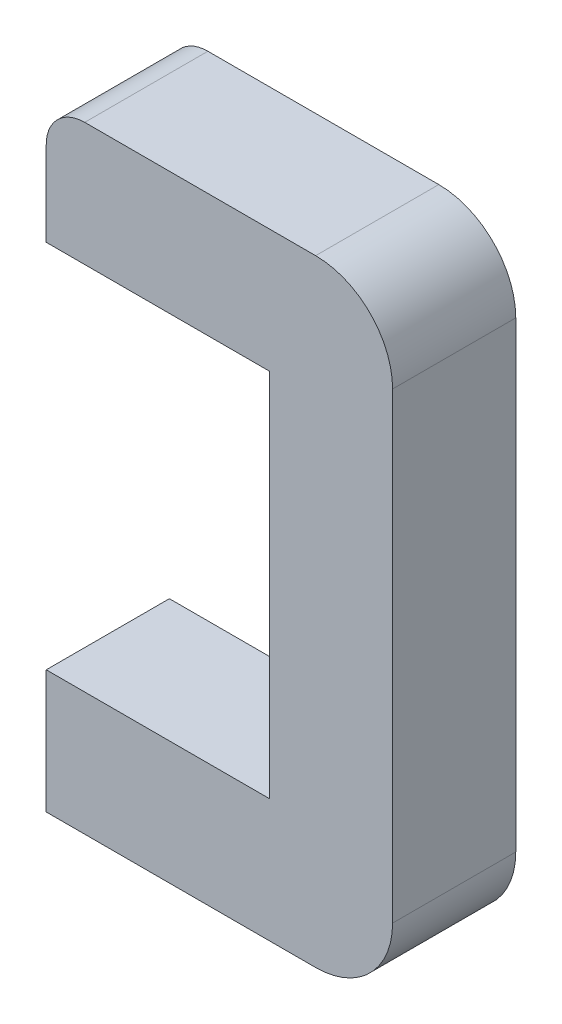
ISO-10303-21;
HEADER;
FILE_DESCRIPTION(('STEP AP214'),'2;1');
FILE_NAME('part.step','',(''),(''),'','','');
FILE_SCHEMA(('AUTOMOTIVE_DESIGN { 1 0 10303 214 1 1 1 1 }'));
ENDSEC;
DATA;
#1=APPLICATION_CONTEXT('core data for automotive mechanical design processes');
#2=APPLICATION_PROTOCOL_DEFINITION('international standard','automotive_design',2000,#1);
#3=PRODUCT_CONTEXT('',#1,'mechanical');
#4=PRODUCT('Part','Part','',(#3));
#5=PRODUCT_RELATED_PRODUCT_CATEGORY('part','',(#4));
#6=PRODUCT_DEFINITION_FORMATION('','',#4);
#7=PRODUCT_DEFINITION_CONTEXT('part definition',#1,'design');
#8=PRODUCT_DEFINITION('design','',#6,#7);
#9=PRODUCT_DEFINITION_SHAPE('','',#8);
#10=(LENGTH_UNIT() NAMED_UNIT(*) SI_UNIT(.MILLI.,.METRE.));
#11=(NAMED_UNIT(*) PLANE_ANGLE_UNIT() SI_UNIT($,.RADIAN.));
#12=(NAMED_UNIT(*) SI_UNIT($,.STERADIAN.) SOLID_ANGLE_UNIT());
#13=UNCERTAINTY_MEASURE_WITH_UNIT(LENGTH_MEASURE(1.E-05),#10,'distance_accuracy_value','');
#14=(GEOMETRIC_REPRESENTATION_CONTEXT(3) GLOBAL_UNCERTAINTY_ASSIGNED_CONTEXT((#13)) GLOBAL_UNIT_ASSIGNED_CONTEXT((#10,
#11,#12)) REPRESENTATION_CONTEXT('',''));
#15=CARTESIAN_POINT('',(0.,0.,0.));
#16=DIRECTION('',(0.,0.,1.));
#17=DIRECTION('',(1.,0.,0.));
#18=AXIS2_PLACEMENT_3D('',#15,#16,#17);
#19=CARTESIAN_POINT('',(30.4849743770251,15.1972857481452,16.));
#20=DIRECTION('',(1.,0.,0.));
#21=DIRECTION('',(0.,1.,0.));
#22=AXIS2_PLACEMENT_3D('',#19,#20,#21);
#23=PLANE('',#22);
#24=DIRECTION('',(0.,-1.,0.));
#25=VECTOR('',#24,1.);
#26=CARTESIAN_POINT('',(30.4849743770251,15.1972857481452,0.));
#27=LINE('',#26,#25);
#28=CARTESIAN_POINT('',(30.4849743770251,15.1972857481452,0.));
#29=VERTEX_POINT('',#28);
#30=CARTESIAN_POINT('',(30.4849743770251,-32.8967142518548,0.));
#31=VERTEX_POINT('',#30);
#32=EDGE_CURVE('E143',#29,#31,#27,.T.);
#33=ORIENTED_EDGE('',*,*,#32,.T.);
#34=DIRECTION('',(0.,0.,-1.));
#35=VECTOR('',#34,1.);
#36=CARTESIAN_POINT('',(30.4849743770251,-32.8967142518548,16.));
#37=LINE('',#36,#35);
#38=CARTESIAN_POINT('',(30.4849743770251,-32.8967142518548,16.));
#39=VERTEX_POINT('',#38);
#40=EDGE_CURVE('E125',#39,#31,#37,.T.);
#41=ORIENTED_EDGE('',*,*,#40,.F.);
#42=DIRECTION('',(0.,-1.,0.));
#43=VECTOR('',#42,1.);
#44=CARTESIAN_POINT('',(30.4849743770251,15.1972857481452,16.));
#45=LINE('',#44,#43);
#46=CARTESIAN_POINT('',(30.4849743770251,15.1972857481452,16.));
#47=VERTEX_POINT('',#46);
#48=EDGE_CURVE('E131',#47,#39,#45,.T.);
#49=ORIENTED_EDGE('',*,*,#48,.F.);
#50=DIRECTION('',(0.,0.,-1.));
#51=VECTOR('',#50,1.);
#52=CARTESIAN_POINT('',(30.4849743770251,15.1972857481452,16.));
#53=LINE('',#52,#51);
#54=EDGE_CURVE('E207',#47,#29,#53,.T.);
#55=ORIENTED_EDGE('',*,*,#54,.T.);
#56=EDGE_LOOP('',(#33,#41,#49,#55));
#57=FACE_BOUND('',#56,.T.);
#58=ADVANCED_FACE('F32',(#57),#23,.F.);
#59=CARTESIAN_POINT('',(1.48497437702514,-32.8967142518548,16.));
#60=DIRECTION('',(0.,-1.,0.));
#61=DIRECTION('',(1.,0.,0.));
#62=AXIS2_PLACEMENT_3D('',#59,#60,#61);
#63=PLANE('',#62);
#64=DIRECTION('',(-1.,0.,0.));
#65=VECTOR('',#64,1.);
#66=CARTESIAN_POINT('',(1.48497437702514,-32.8967142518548,0.));
#67=LINE('',#66,#65);
#68=CARTESIAN_POINT('',(1.48497437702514,-32.8967142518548,0.));
#69=VERTEX_POINT('',#68);
#70=EDGE_CURVE('E198',#31,#69,#67,.T.);
#71=ORIENTED_EDGE('',*,*,#70,.T.);
#72=DIRECTION('',(0.,0.,-1.));
#73=VECTOR('',#72,1.);
#74=CARTESIAN_POINT('',(1.48497437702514,-32.8967142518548,16.));
#75=LINE('',#74,#73);
#76=CARTESIAN_POINT('',(1.48497437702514,-32.8967142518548,16.));
#77=VERTEX_POINT('',#76);
#78=EDGE_CURVE('E128',#77,#69,#75,.T.);
#79=ORIENTED_EDGE('',*,*,#78,.F.);
#80=DIRECTION('',(-1.,0.,0.));
#81=VECTOR('',#80,1.);
#82=CARTESIAN_POINT('',(1.48497437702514,-32.8967142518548,16.));
#83=LINE('',#82,#81);
#84=EDGE_CURVE('E121',#39,#77,#83,.T.);
#85=ORIENTED_EDGE('',*,*,#84,.F.);
#86=ORIENTED_EDGE('',*,*,#40,.T.);
#87=EDGE_LOOP('',(#71,#79,#85,#86));
#88=FACE_BOUND('',#87,.T.);
#89=ADVANCED_FACE('F123',(#88),#63,.F.);
#90=CARTESIAN_POINT('',(1.48497437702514,-32.8967142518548,16.));
#91=DIRECTION('',(1.,0.,0.));
#92=DIRECTION('',(0.,1.,0.));
#93=AXIS2_PLACEMENT_3D('',#90,#91,#92);
#94=PLANE('',#93);
#95=DIRECTION('',(0.,-1.,0.));
#96=VECTOR('',#95,1.);
#97=CARTESIAN_POINT('',(1.48497437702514,-32.8967142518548,0.));
#98=LINE('',#97,#96);
#99=CARTESIAN_POINT('',(1.48497437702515,-48.8867142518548,0.));
#100=VERTEX_POINT('',#99);
#101=EDGE_CURVE('E193',#69,#100,#98,.T.);
#102=ORIENTED_EDGE('',*,*,#101,.T.);
#103=DIRECTION('',(0.,0.,-1.));
#104=VECTOR('',#103,1.);
#105=CARTESIAN_POINT('',(1.48497437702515,-48.8867142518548,16.));
#106=LINE('',#105,#104);
#107=CARTESIAN_POINT('',(1.48497437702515,-48.8867142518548,16.));
#108=VERTEX_POINT('',#107);
#109=EDGE_CURVE('E40',#100,#108,#106,.F.);
#110=ORIENTED_EDGE('',*,*,#109,.T.);
#111=DIRECTION('',(0.,-1.,0.));
#112=VECTOR('',#111,1.);
#113=CARTESIAN_POINT('',(1.48497437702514,-32.8967142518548,16.));
#114=LINE('',#113,#112);
#115=EDGE_CURVE('E130',#77,#108,#114,.T.);
#116=ORIENTED_EDGE('',*,*,#115,.F.);
#117=ORIENTED_EDGE('',*,*,#78,.T.);
#118=EDGE_LOOP('',(#102,#110,#116,#117));
#119=FACE_BOUND('',#118,.T.);
#120=ADVANCED_FACE('F240',(#119),#94,.F.);
#121=CARTESIAN_POINT('',(1.48497437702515,-48.8967142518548,16.));
#122=DIRECTION('',(0.,1.,0.));
#123=DIRECTION('',(0.,0.,1.));
#124=AXIS2_PLACEMENT_3D('',#121,#122,#123);
#125=PLANE('',#124);
#126=DIRECTION('',(1.,0.,0.));
#127=VECTOR('',#126,1.);
#128=CARTESIAN_POINT('',(1.48497437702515,-48.8967142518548,16.));
#129=LINE('',#128,#127);
#130=CARTESIAN_POINT('',(1.49497437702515,-48.8967142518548,16.));
#131=VERTEX_POINT('',#130);
#132=CARTESIAN_POINT('',(36.4849743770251,-48.8967142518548,16.));
#133=VERTEX_POINT('',#132);
#134=EDGE_CURVE('E186',#131,#133,#129,.T.);
#135=ORIENTED_EDGE('',*,*,#134,.F.);
#136=DIRECTION('',(0.,0.,-1.));
#137=VECTOR('',#136,1.);
#138=CARTESIAN_POINT('',(1.49497437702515,-48.8967142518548,16.));
#139=LINE('',#138,#137);
#140=CARTESIAN_POINT('',(1.49497437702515,-48.8967142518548,0.));
#141=VERTEX_POINT('',#140);
#142=EDGE_CURVE('E178',#131,#141,#139,.T.);
#143=ORIENTED_EDGE('',*,*,#142,.T.);
#144=DIRECTION('',(1.,0.,0.));
#145=VECTOR('',#144,1.);
#146=CARTESIAN_POINT('',(1.48497437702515,-48.8967142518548,0.));
#147=LINE('',#146,#145);
#148=CARTESIAN_POINT('',(36.4849743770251,-48.8967142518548,0.));
#149=VERTEX_POINT('',#148);
#150=EDGE_CURVE('E185',#141,#149,#147,.T.);
#151=ORIENTED_EDGE('',*,*,#150,.T.);
#152=DIRECTION('',(0.,0.,-1.));
#153=VECTOR('',#152,1.);
#154=CARTESIAN_POINT('',(36.4849743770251,-48.8967142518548,16.));
#155=LINE('',#154,#153);
#156=EDGE_CURVE('E159',#149,#133,#155,.F.);
#157=ORIENTED_EDGE('',*,*,#156,.T.);
#158=EDGE_LOOP('',(#135,#143,#151,#157));
#159=FACE_BOUND('',#158,.T.);
#160=ADVANCED_FACE('F184',(#159),#125,.F.);
#161=CARTESIAN_POINT('',(46.4849743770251,31.1972857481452,16.));
#162=DIRECTION('',(-1.,0.,0.));
#163=DIRECTION('',(0.,0.,1.));
#164=AXIS2_PLACEMENT_3D('',#161,#162,#163);
#165=PLANE('',#164);
#166=DIRECTION('',(0.,1.,0.));
#167=VECTOR('',#166,1.);
#168=CARTESIAN_POINT('',(46.4849743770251,31.1972857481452,16.));
#169=LINE('',#168,#167);
#170=CARTESIAN_POINT('',(46.4849743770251,-38.8967142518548,16.));
#171=VERTEX_POINT('',#170);
#172=CARTESIAN_POINT('',(46.4849743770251,21.1972857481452,16.));
#173=VERTEX_POINT('',#172);
#174=EDGE_CURVE('E224',#171,#173,#169,.T.);
#175=ORIENTED_EDGE('',*,*,#174,.F.);
#176=DIRECTION('',(0.,0.,-1.));
#177=VECTOR('',#176,1.);
#178=CARTESIAN_POINT('',(46.4849743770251,-38.8967142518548,16.));
#179=LINE('',#178,#177);
#180=CARTESIAN_POINT('',(46.4849743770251,-38.8967142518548,0.));
#181=VERTEX_POINT('',#180);
#182=EDGE_CURVE('E146',#171,#181,#179,.T.);
#183=ORIENTED_EDGE('',*,*,#182,.T.);
#184=DIRECTION('',(0.,1.,0.));
#185=VECTOR('',#184,1.);
#186=CARTESIAN_POINT('',(46.4849743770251,31.1972857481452,0.));
#187=LINE('',#186,#185);
#188=CARTESIAN_POINT('',(46.4849743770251,21.1972857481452,0.));
#189=VERTEX_POINT('',#188);
#190=EDGE_CURVE('E192',#181,#189,#187,.T.);
#191=ORIENTED_EDGE('',*,*,#190,.T.);
#192=DIRECTION('',(0.,0.,-1.));
#193=VECTOR('',#192,1.);
#194=CARTESIAN_POINT('',(46.4849743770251,21.1972857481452,16.));
#195=LINE('',#194,#193);
#196=EDGE_CURVE('E144',#189,#173,#195,.F.);
#197=ORIENTED_EDGE('',*,*,#196,.T.);
#198=EDGE_LOOP('',(#175,#183,#191,#197));
#199=FACE_BOUND('',#198,.T.);
#200=ADVANCED_FACE('F271',(#199),#165,.F.);
#201=CARTESIAN_POINT('',(1.48497437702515,31.1972857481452,16.));
#202=DIRECTION('',(0.,-1.,0.));
#203=DIRECTION('',(0.,0.,-1.));
#204=AXIS2_PLACEMENT_3D('',#201,#202,#203);
#205=PLANE('',#204);
#206=DIRECTION('',(-1.,0.,0.));
#207=VECTOR('',#206,1.);
#208=CARTESIAN_POINT('',(1.48497437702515,31.1972857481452,0.));
#209=LINE('',#208,#207);
#210=CARTESIAN_POINT('',(36.4849743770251,31.1972857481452,0.));
#211=VERTEX_POINT('',#210);
#212=CARTESIAN_POINT('',(6.48497437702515,31.1972857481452,0.));
#213=VERTEX_POINT('',#212);
#214=EDGE_CURVE('E196',#211,#213,#209,.T.);
#215=ORIENTED_EDGE('',*,*,#214,.T.);
#216=DIRECTION('',(0.,0.,-1.));
#217=VECTOR('',#216,1.);
#218=CARTESIAN_POINT('',(6.48497437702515,31.1972857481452,16.));
#219=LINE('',#218,#217);
#220=CARTESIAN_POINT('',(6.48497437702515,31.1972857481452,16.));
#221=VERTEX_POINT('',#220);
#222=EDGE_CURVE('E174',#213,#221,#219,.F.);
#223=ORIENTED_EDGE('',*,*,#222,.T.);
#224=DIRECTION('',(-1.,0.,0.));
#225=VECTOR('',#224,1.);
#226=CARTESIAN_POINT('',(1.48497437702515,31.1972857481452,16.));
#227=LINE('',#226,#225);
#228=CARTESIAN_POINT('',(36.4849743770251,31.1972857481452,16.));
#229=VERTEX_POINT('',#228);
#230=EDGE_CURVE('E221',#229,#221,#227,.T.);
#231=ORIENTED_EDGE('',*,*,#230,.F.);
#232=DIRECTION('',(0.,0.,-1.));
#233=VECTOR('',#232,1.);
#234=CARTESIAN_POINT('',(36.4849743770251,31.1972857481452,16.));
#235=LINE('',#234,#233);
#236=EDGE_CURVE('E166',#229,#211,#235,.T.);
#237=ORIENTED_EDGE('',*,*,#236,.T.);
#238=EDGE_LOOP('',(#215,#223,#231,#237));
#239=FACE_BOUND('',#238,.T.);
#240=ADVANCED_FACE('F259',(#239),#205,.F.);
#241=CARTESIAN_POINT('',(1.48497437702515,31.1972857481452,16.));
#242=DIRECTION('',(1.,0.,0.));
#243=DIRECTION('',(0.,0.,-1.));
#244=AXIS2_PLACEMENT_3D('',#241,#242,#243);
#245=PLANE('',#244);
#246=DIRECTION('',(0.,-1.,0.));
#247=VECTOR('',#246,1.);
#248=CARTESIAN_POINT('',(1.48497437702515,31.1972857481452,16.));
#249=LINE('',#248,#247);
#250=CARTESIAN_POINT('',(1.48497437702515,26.1972857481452,16.));
#251=VERTEX_POINT('',#250);
#252=CARTESIAN_POINT('',(1.48497437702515,15.1972857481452,16.));
#253=VERTEX_POINT('',#252);
#254=EDGE_CURVE('E219',#251,#253,#249,.T.);
#255=ORIENTED_EDGE('',*,*,#254,.F.);
#256=DIRECTION('',(0.,0.,-1.));
#257=VECTOR('',#256,1.);
#258=CARTESIAN_POINT('',(1.48497437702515,26.1972857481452,16.));
#259=LINE('',#258,#257);
#260=CARTESIAN_POINT('',(1.48497437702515,26.1972857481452,0.));
#261=VERTEX_POINT('',#260);
#262=EDGE_CURVE('E169',#251,#261,#259,.T.);
#263=ORIENTED_EDGE('',*,*,#262,.T.);
#264=DIRECTION('',(0.,-1.,0.));
#265=VECTOR('',#264,1.);
#266=CARTESIAN_POINT('',(1.48497437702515,31.1972857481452,0.));
#267=LINE('',#266,#265);
#268=CARTESIAN_POINT('',(1.48497437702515,15.1972857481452,0.));
#269=VERTEX_POINT('',#268);
#270=EDGE_CURVE('E204',#261,#269,#267,.T.);
#271=ORIENTED_EDGE('',*,*,#270,.T.);
#272=DIRECTION('',(0.,0.,-1.));
#273=VECTOR('',#272,1.);
#274=CARTESIAN_POINT('',(1.48497437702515,15.1972857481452,16.));
#275=LINE('',#274,#273);
#276=EDGE_CURVE('E148',#253,#269,#275,.T.);
#277=ORIENTED_EDGE('',*,*,#276,.F.);
#278=EDGE_LOOP('',(#255,#263,#271,#277));
#279=FACE_BOUND('',#278,.T.);
#280=ADVANCED_FACE('F263',(#279),#245,.F.);
#281=CARTESIAN_POINT('',(1.48497437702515,15.1972857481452,16.));
#282=DIRECTION('',(0.,1.,0.));
#283=DIRECTION('',(-1.,0.,0.));
#284=AXIS2_PLACEMENT_3D('',#281,#282,#283);
#285=PLANE('',#284);
#286=DIRECTION('',(1.,0.,0.));
#287=VECTOR('',#286,1.);
#288=CARTESIAN_POINT('',(1.48497437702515,15.1972857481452,0.));
#289=LINE('',#288,#287);
#290=EDGE_CURVE('E140',#269,#29,#289,.T.);
#291=ORIENTED_EDGE('',*,*,#290,.T.);
#292=ORIENTED_EDGE('',*,*,#54,.F.);
#293=DIRECTION('',(1.,0.,0.));
#294=VECTOR('',#293,1.);
#295=CARTESIAN_POINT('',(1.48497437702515,15.1972857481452,16.));
#296=LINE('',#295,#294);
#297=EDGE_CURVE('E136',#253,#47,#296,.T.);
#298=ORIENTED_EDGE('',*,*,#297,.F.);
#299=ORIENTED_EDGE('',*,*,#276,.T.);
#300=EDGE_LOOP('',(#291,#292,#298,#299));
#301=FACE_BOUND('',#300,.T.);
#302=ADVANCED_FACE('F212',(#301),#285,.F.);
#303=CARTESIAN_POINT('',(0.,0.,16.));
#304=DIRECTION('',(0.,0.,1.));
#305=DIRECTION('',(1.,0.,0.));
#306=AXIS2_PLACEMENT_3D('',#303,#304,#305);
#307=PLANE('',#306);
#308=ORIENTED_EDGE('',*,*,#115,.T.);
#309=CARTESIAN_POINT('',(1.49497437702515,-48.8867142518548,16.));
#310=DIRECTION('',(0.,0.,1.));
#311=DIRECTION('',(1.,0.,0.));
#312=AXIS2_PLACEMENT_3D('',#309,#310,#311);
#313=CIRCLE('',#312,0.01);
#314=EDGE_CURVE('E11',#108,#131,#313,.T.);
#315=ORIENTED_EDGE('',*,*,#314,.T.);
#316=ORIENTED_EDGE('',*,*,#134,.T.);
#317=CARTESIAN_POINT('',(36.4849743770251,-38.8967142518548,16.));
#318=DIRECTION('',(0.,0.,1.));
#319=DIRECTION('',(1.,0.,0.));
#320=AXIS2_PLACEMENT_3D('',#317,#318,#319);
#321=CIRCLE('',#320,10.);
#322=EDGE_CURVE('E164',#133,#171,#321,.T.);
#323=ORIENTED_EDGE('',*,*,#322,.T.);
#324=ORIENTED_EDGE('',*,*,#174,.T.);
#325=CARTESIAN_POINT('',(36.4849743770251,21.1972857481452,16.));
#326=DIRECTION('',(0.,0.,1.));
#327=DIRECTION('',(1.,0.,0.));
#328=AXIS2_PLACEMENT_3D('',#325,#326,#327);
#329=CIRCLE('',#328,10.);
#330=EDGE_CURVE('E162',#173,#229,#329,.T.);
#331=ORIENTED_EDGE('',*,*,#330,.T.);
#332=ORIENTED_EDGE('',*,*,#230,.T.);
#333=CARTESIAN_POINT('',(6.48497437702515,26.1972857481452,16.));
#334=DIRECTION('',(0.,0.,1.));
#335=DIRECTION('',(1.,0.,0.));
#336=AXIS2_PLACEMENT_3D('',#333,#334,#335);
#337=CIRCLE('',#336,5.);
#338=EDGE_CURVE('E176',#221,#251,#337,.T.);
#339=ORIENTED_EDGE('',*,*,#338,.T.);
#340=ORIENTED_EDGE('',*,*,#254,.T.);
#341=ORIENTED_EDGE('',*,*,#297,.T.);
#342=ORIENTED_EDGE('',*,*,#48,.T.);
#343=ORIENTED_EDGE('',*,*,#84,.T.);
#344=EDGE_LOOP('',(#308,#315,#316,#323,#324,#331,#332,#339,#340,#341,#342,#343));
#345=FACE_BOUND('',#344,.T.);
#346=ADVANCED_FACE('F134',(#345),#307,.T.);
#347=CARTESIAN_POINT('',(0.,0.,0.));
#348=DIRECTION('',(0.,0.,1.));
#349=DIRECTION('',(1.,0.,0.));
#350=AXIS2_PLACEMENT_3D('',#347,#348,#349);
#351=PLANE('',#350);
#352=ORIENTED_EDGE('',*,*,#150,.F.);
#353=CARTESIAN_POINT('',(1.49497437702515,-48.8867142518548,0.));
#354=DIRECTION('',(0.,0.,1.));
#355=DIRECTION('',(1.,0.,0.));
#356=AXIS2_PLACEMENT_3D('',#353,#354,#355);
#357=CIRCLE('',#356,0.01);
#358=EDGE_CURVE('E54',#141,#100,#357,.F.);
#359=ORIENTED_EDGE('',*,*,#358,.T.);
#360=ORIENTED_EDGE('',*,*,#101,.F.);
#361=ORIENTED_EDGE('',*,*,#70,.F.);
#362=ORIENTED_EDGE('',*,*,#32,.F.);
#363=ORIENTED_EDGE('',*,*,#290,.F.);
#364=ORIENTED_EDGE('',*,*,#270,.F.);
#365=CARTESIAN_POINT('',(6.48497437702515,26.1972857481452,0.));
#366=DIRECTION('',(0.,0.,1.));
#367=DIRECTION('',(1.,0.,0.));
#368=AXIS2_PLACEMENT_3D('',#365,#366,#367);
#369=CIRCLE('',#368,5.);
#370=EDGE_CURVE('E172',#261,#213,#369,.F.);
#371=ORIENTED_EDGE('',*,*,#370,.T.);
#372=ORIENTED_EDGE('',*,*,#214,.F.);
#373=CARTESIAN_POINT('',(36.4849743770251,21.1972857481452,0.));
#374=DIRECTION('',(0.,0.,1.));
#375=DIRECTION('',(1.,0.,0.));
#376=AXIS2_PLACEMENT_3D('',#373,#374,#375);
#377=CIRCLE('',#376,10.);
#378=EDGE_CURVE('E154',#211,#189,#377,.F.);
#379=ORIENTED_EDGE('',*,*,#378,.T.);
#380=ORIENTED_EDGE('',*,*,#190,.F.);
#381=CARTESIAN_POINT('',(36.4849743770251,-38.8967142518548,0.));
#382=DIRECTION('',(0.,0.,1.));
#383=DIRECTION('',(1.,0.,0.));
#384=AXIS2_PLACEMENT_3D('',#381,#382,#383);
#385=CIRCLE('',#384,10.);
#386=EDGE_CURVE('E156',#181,#149,#385,.F.);
#387=ORIENTED_EDGE('',*,*,#386,.T.);
#388=EDGE_LOOP('',(#352,#359,#360,#361,#362,#363,#364,#371,#372,#379,#380,#387));
#389=FACE_BOUND('',#388,.T.);
#390=ADVANCED_FACE('F189',(#389),#351,.F.);
#391=CARTESIAN_POINT('',(36.4849743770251,-38.8967142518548,16.));
#392=DIRECTION('',(0.,0.,-1.));
#393=DIRECTION('',(-1.,0.,0.));
#394=AXIS2_PLACEMENT_3D('',#391,#392,#393);
#395=CYLINDRICAL_SURFACE('',#394,10.);
#396=ORIENTED_EDGE('',*,*,#322,.F.);
#397=ORIENTED_EDGE('',*,*,#156,.F.);
#398=ORIENTED_EDGE('',*,*,#386,.F.);
#399=ORIENTED_EDGE('',*,*,#182,.F.);
#400=EDGE_LOOP('',(#396,#397,#398,#399));
#401=FACE_BOUND('',#400,.T.);
#402=ADVANCED_FACE('F244',(#401),#395,.T.);
#403=CARTESIAN_POINT('',(36.4849743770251,21.1972857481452,16.));
#404=DIRECTION('',(0.,0.,-1.));
#405=DIRECTION('',(-1.,0.,0.));
#406=AXIS2_PLACEMENT_3D('',#403,#404,#405);
#407=CYLINDRICAL_SURFACE('',#406,10.);
#408=ORIENTED_EDGE('',*,*,#330,.F.);
#409=ORIENTED_EDGE('',*,*,#196,.F.);
#410=ORIENTED_EDGE('',*,*,#378,.F.);
#411=ORIENTED_EDGE('',*,*,#236,.F.);
#412=EDGE_LOOP('',(#408,#409,#410,#411));
#413=FACE_BOUND('',#412,.T.);
#414=ADVANCED_FACE('F233',(#413),#407,.T.);
#415=CARTESIAN_POINT('',(6.48497437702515,26.1972857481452,16.));
#416=DIRECTION('',(0.,0.,-1.));
#417=DIRECTION('',(-1.,0.,0.));
#418=AXIS2_PLACEMENT_3D('',#415,#416,#417);
#419=CYLINDRICAL_SURFACE('',#418,5.);
#420=ORIENTED_EDGE('',*,*,#338,.F.);
#421=ORIENTED_EDGE('',*,*,#222,.F.);
#422=ORIENTED_EDGE('',*,*,#370,.F.);
#423=ORIENTED_EDGE('',*,*,#262,.F.);
#424=EDGE_LOOP('',(#420,#421,#422,#423));
#425=FACE_BOUND('',#424,.T.);
#426=ADVANCED_FACE('F229',(#425),#419,.T.);
#427=CARTESIAN_POINT('',(1.49497437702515,-48.8867142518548,16.));
#428=DIRECTION('',(0.,0.,-1.));
#429=DIRECTION('',(-1.,0.,0.));
#430=AXIS2_PLACEMENT_3D('',#427,#428,#429);
#431=CYLINDRICAL_SURFACE('',#430,0.01);
#432=ORIENTED_EDGE('',*,*,#314,.F.);
#433=ORIENTED_EDGE('',*,*,#109,.F.);
#434=ORIENTED_EDGE('',*,*,#358,.F.);
#435=ORIENTED_EDGE('',*,*,#142,.F.);
#436=EDGE_LOOP('',(#432,#433,#434,#435));
#437=FACE_BOUND('',#436,.T.);
#438=ADVANCED_FACE('F34',(#437),#431,.T.);
#439=CLOSED_SHELL('',(#58,#89,#120,#160,#200,#240,#280,#302,#346,#390,#402,#414,#426,#438));
#440=MANIFOLD_SOLID_BREP('B2',#439);
#441=ADVANCED_BREP_SHAPE_REPRESENTATION('',(#18,#440),#14);
#442=SHAPE_DEFINITION_REPRESENTATION(#9,#441);
ENDSEC;
END-ISO-10303-21;
